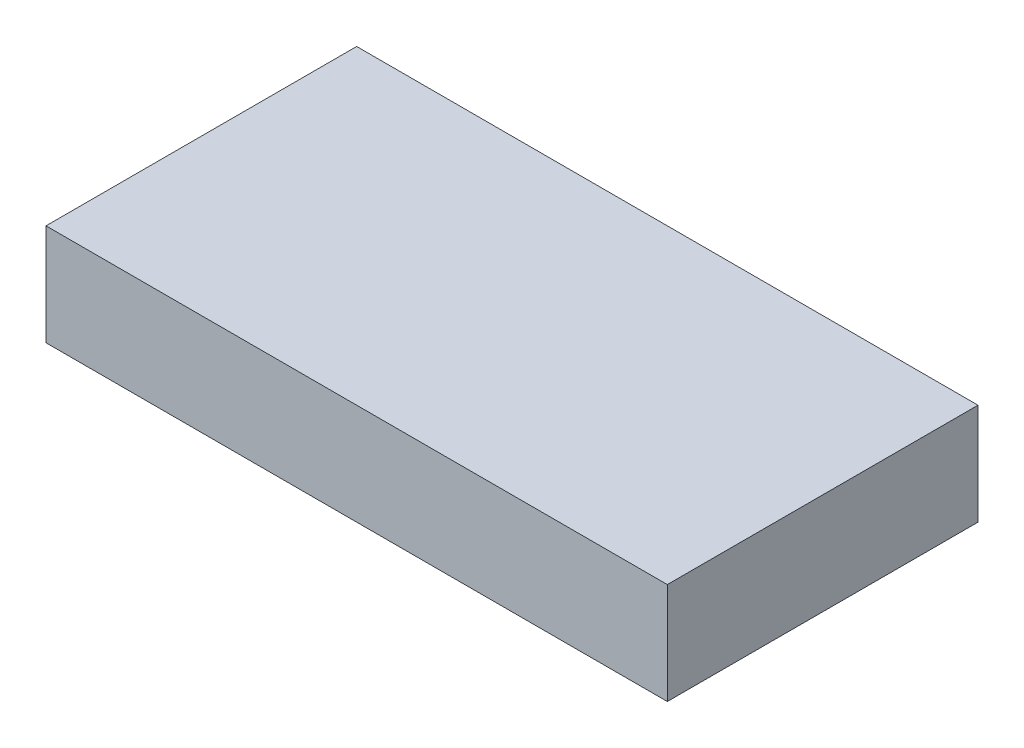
from build123d import *

# Parameters (mm, degrees)
SKETCH1_W           = 230
SKETCH1_H           = 115
BOSS_EXTRUDE1_DEPTH = 18.75


with BuildPart() as part:
    # Sketch1 → Boss-Extrude1 (new, symmetric)
    with BuildSketch(Plane(origin=(0, 0, 0), x_dir=(1, 0, 0), z_dir=(0, 1, 0))):
        Rectangle(SKETCH1_W, SKETCH1_H)
    extrude(amount=BOSS_EXTRUDE1_DEPTH, both=True)


solid = part.part
